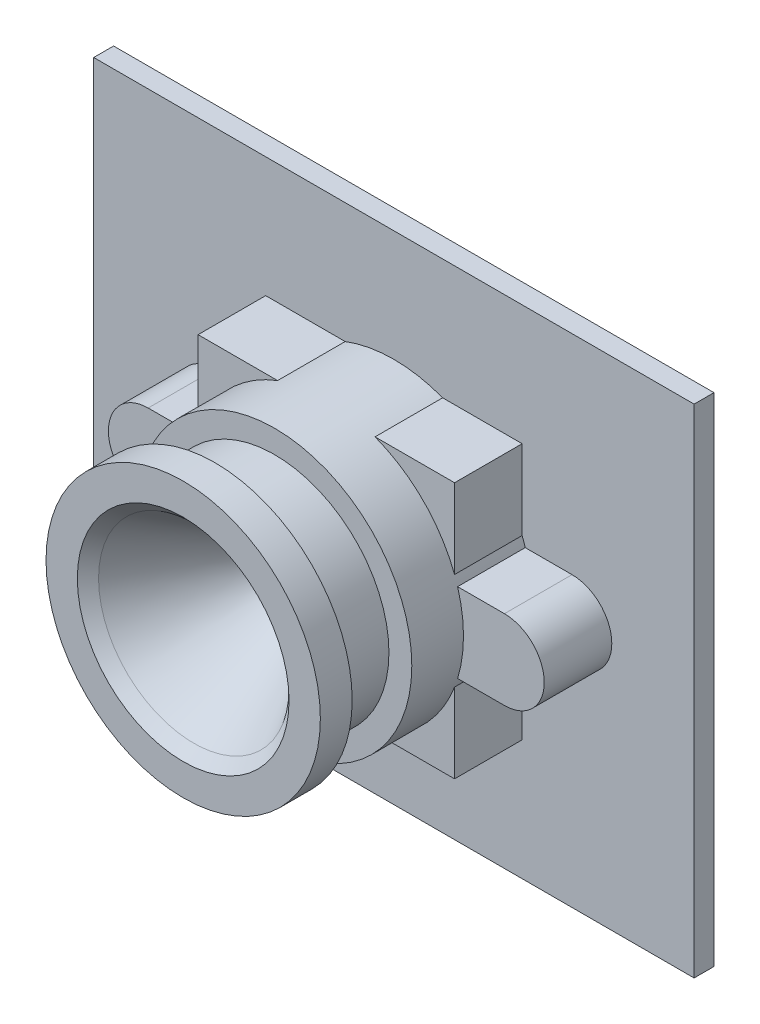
ISO-10303-21;
HEADER;
FILE_DESCRIPTION(('STEP AP214'),'2;1');
FILE_NAME('part.step','',(''),(''),'','','');
FILE_SCHEMA(('AUTOMOTIVE_DESIGN { 1 0 10303 214 1 1 1 1 }'));
ENDSEC;
DATA;
#1=APPLICATION_CONTEXT('core data for automotive mechanical design processes');
#2=APPLICATION_PROTOCOL_DEFINITION('international standard','automotive_design',2000,#1);
#3=PRODUCT_CONTEXT('',#1,'mechanical');
#4=PRODUCT('Part','Part','',(#3));
#5=PRODUCT_RELATED_PRODUCT_CATEGORY('part','',(#4));
#6=PRODUCT_DEFINITION_FORMATION('','',#4);
#7=PRODUCT_DEFINITION_CONTEXT('part definition',#1,'design');
#8=PRODUCT_DEFINITION('design','',#6,#7);
#9=PRODUCT_DEFINITION_SHAPE('','',#8);
#10=(LENGTH_UNIT() NAMED_UNIT(*) SI_UNIT(.MILLI.,.METRE.));
#11=(NAMED_UNIT(*) PLANE_ANGLE_UNIT() SI_UNIT($,.RADIAN.));
#12=(NAMED_UNIT(*) SI_UNIT($,.STERADIAN.) SOLID_ANGLE_UNIT());
#13=UNCERTAINTY_MEASURE_WITH_UNIT(LENGTH_MEASURE(1.E-05),#10,'distance_accuracy_value','');
#14=(GEOMETRIC_REPRESENTATION_CONTEXT(3) GLOBAL_UNCERTAINTY_ASSIGNED_CONTEXT((#13)) GLOBAL_UNIT_ASSIGNED_CONTEXT((#10,
#11,#12)) REPRESENTATION_CONTEXT('',''));
#15=CARTESIAN_POINT('',(0.,0.,0.));
#16=DIRECTION('',(0.,0.,1.));
#17=DIRECTION('',(1.,0.,0.));
#18=AXIS2_PLACEMENT_3D('',#15,#16,#17);
#19=CARTESIAN_POINT('',(-1.8,-12.5,-3.25));
#20=DIRECTION('',(-1.,0.,0.));
#21=DIRECTION('',(0.,0.,1.));
#22=AXIS2_PLACEMENT_3D('',#19,#20,#21);
#23=PLANE('',#22);
#24=DIRECTION('',(0.,-1.,0.));
#25=VECTOR('',#24,1.);
#26=CARTESIAN_POINT('',(-1.8,-12.5,0.));
#27=LINE('',#26,#25);
#28=CARTESIAN_POINT('',(-1.8,-8.1,0.));
#29=VERTEX_POINT('',#28);
#30=CARTESIAN_POINT('',(-1.8,-12.5,0.));
#31=VERTEX_POINT('',#30);
#32=EDGE_CURVE('E162',#29,#31,#27,.T.);
#33=ORIENTED_EDGE('',*,*,#32,.T.);
#34=DIRECTION('',(0.,0.,1.));
#35=VECTOR('',#34,1.);
#36=CARTESIAN_POINT('',(-1.8,-12.5,-3.25));
#37=LINE('',#36,#35);
#38=CARTESIAN_POINT('',(-1.8,-12.5,-3.25));
#39=VERTEX_POINT('',#38);
#40=EDGE_CURVE('E12',#39,#31,#37,.T.);
#41=ORIENTED_EDGE('',*,*,#40,.F.);
#42=DIRECTION('',(0.,-1.,0.));
#43=VECTOR('',#42,1.);
#44=CARTESIAN_POINT('',(-1.8,-12.5,-3.25));
#45=LINE('',#44,#43);
#46=CARTESIAN_POINT('',(-1.8,-8.1,-3.25));
#47=VERTEX_POINT('',#46);
#48=EDGE_CURVE('E166',#47,#39,#45,.T.);
#49=ORIENTED_EDGE('',*,*,#48,.F.);
#50=DIRECTION('',(0.,0.,1.));
#51=VECTOR('',#50,1.);
#52=CARTESIAN_POINT('',(-1.8,-8.1,-3.25));
#53=LINE('',#52,#51);
#54=EDGE_CURVE('E172',#47,#29,#53,.T.);
#55=ORIENTED_EDGE('',*,*,#54,.T.);
#56=EDGE_LOOP('',(#33,#41,#49,#55));
#57=FACE_BOUND('',#56,.T.);
#58=ADVANCED_FACE('F54',(#57),#23,.F.);
#59=CARTESIAN_POINT('',(-1.8,-12.5,-3.25));
#60=DIRECTION('',(0.,1.,0.));
#61=DIRECTION('',(0.,0.,1.));
#62=AXIS2_PLACEMENT_3D('',#59,#60,#61);
#63=PLANE('',#62);
#64=DIRECTION('',(1.,0.,0.));
#65=VECTOR('',#64,1.);
#66=CARTESIAN_POINT('',(-8.7,-12.5,-2.85));
#67=LINE('',#66,#65);
#68=CARTESIAN_POINT('',(-8.7,-12.5,-2.85));
#69=VERTEX_POINT('',#68);
#70=CARTESIAN_POINT('',(-2.2,-12.5,-2.85));
#71=VERTEX_POINT('',#70);
#72=EDGE_CURVE('E156',#69,#71,#67,.T.);
#73=ORIENTED_EDGE('',*,*,#72,.F.);
#74=DIRECTION('',(0.,0.,-1.));
#75=VECTOR('',#74,1.);
#76=CARTESIAN_POINT('',(-8.7,-12.5,-0.4));
#77=LINE('',#76,#75);
#78=CARTESIAN_POINT('',(-8.7,-12.5,-0.4));
#79=VERTEX_POINT('',#78);
#80=EDGE_CURVE('E68',#79,#69,#77,.T.);
#81=ORIENTED_EDGE('',*,*,#80,.F.);
#82=DIRECTION('',(-1.,0.,0.));
#83=VECTOR('',#82,1.);
#84=CARTESIAN_POINT('',(-8.7,-12.5,-0.4));
#85=LINE('',#84,#83);
#86=CARTESIAN_POINT('',(-2.2,-12.5,-0.4));
#87=VERTEX_POINT('',#86);
#88=EDGE_CURVE('E147',#87,#79,#85,.T.);
#89=ORIENTED_EDGE('',*,*,#88,.F.);
#90=DIRECTION('',(0.,0.,1.));
#91=VECTOR('',#90,1.);
#92=CARTESIAN_POINT('',(-2.2,-12.5,-0.4));
#93=LINE('',#92,#91);
#94=EDGE_CURVE('E150',#71,#87,#93,.T.);
#95=ORIENTED_EDGE('',*,*,#94,.F.);
#96=EDGE_LOOP('',(#73,#81,#89,#95));
#97=FACE_BOUND('',#96,.T.);
#98=DIRECTION('',(-1.,0.,0.));
#99=VECTOR('',#98,1.);
#100=CARTESIAN_POINT('',(-1.8,-12.5,0.));
#101=LINE('',#100,#99);
#102=CARTESIAN_POINT('',(-9.1,-12.5,0.));
#103=VERTEX_POINT('',#102);
#104=EDGE_CURVE('E175',#31,#103,#101,.T.);
#105=ORIENTED_EDGE('',*,*,#104,.T.);
#106=DIRECTION('',(0.,0.,1.));
#107=VECTOR('',#106,1.);
#108=CARTESIAN_POINT('',(-9.1,-12.5,-3.25));
#109=LINE('',#108,#107);
#110=CARTESIAN_POINT('',(-9.1,-12.5,-3.25));
#111=VERTEX_POINT('',#110);
#112=EDGE_CURVE('E61',#111,#103,#109,.T.);
#113=ORIENTED_EDGE('',*,*,#112,.F.);
#114=DIRECTION('',(-1.,0.,0.));
#115=VECTOR('',#114,1.);
#116=CARTESIAN_POINT('',(-1.8,-12.5,-3.25));
#117=LINE('',#116,#115);
#118=EDGE_CURVE('E105',#39,#111,#117,.T.);
#119=ORIENTED_EDGE('',*,*,#118,.F.);
#120=ORIENTED_EDGE('',*,*,#40,.T.);
#121=EDGE_LOOP('',(#105,#113,#119,#120));
#122=FACE_BOUND('',#121,.T.);
#123=ADVANCED_FACE('F203',(#97,#122),#63,.F.);
#124=CARTESIAN_POINT('',(-9.1,-12.5,-3.25));
#125=DIRECTION('',(1.,0.,0.));
#126=DIRECTION('',(0.,0.,-1.));
#127=AXIS2_PLACEMENT_3D('',#124,#125,#126);
#128=PLANE('',#127);
#129=DIRECTION('',(0.,1.,0.));
#130=VECTOR('',#129,1.);
#131=CARTESIAN_POINT('',(-9.1,-12.5,0.));
#132=LINE('',#131,#130);
#133=CARTESIAN_POINT('',(-9.1,-8.1,0.));
#134=VERTEX_POINT('',#133);
#135=EDGE_CURVE('E177',#103,#134,#132,.T.);
#136=ORIENTED_EDGE('',*,*,#135,.T.);
#137=DIRECTION('',(0.,0.,1.));
#138=VECTOR('',#137,1.);
#139=CARTESIAN_POINT('',(-9.1,-8.1,-3.25));
#140=LINE('',#139,#138);
#141=CARTESIAN_POINT('',(-9.1,-8.1,-3.25));
#142=VERTEX_POINT('',#141);
#143=EDGE_CURVE('E181',#142,#134,#140,.T.);
#144=ORIENTED_EDGE('',*,*,#143,.F.);
#145=DIRECTION('',(0.,1.,0.));
#146=VECTOR('',#145,1.);
#147=CARTESIAN_POINT('',(-9.1,-12.5,-3.25));
#148=LINE('',#147,#146);
#149=EDGE_CURVE('E169',#111,#142,#148,.T.);
#150=ORIENTED_EDGE('',*,*,#149,.F.);
#151=ORIENTED_EDGE('',*,*,#112,.T.);
#152=EDGE_LOOP('',(#136,#144,#150,#151));
#153=FACE_BOUND('',#152,.T.);
#154=ADVANCED_FACE('F186',(#153),#128,.F.);
#155=CARTESIAN_POINT('',(-1.8,-8.1,-3.25));
#156=DIRECTION('',(0.,-1.,0.));
#157=DIRECTION('',(0.,0.,-1.));
#158=AXIS2_PLACEMENT_3D('',#155,#156,#157);
#159=PLANE('',#158);
#160=DIRECTION('',(1.,0.,0.));
#161=VECTOR('',#160,1.);
#162=CARTESIAN_POINT('',(-1.8,-8.1,0.));
#163=LINE('',#162,#161);
#164=EDGE_CURVE('E98',#134,#29,#163,.T.);
#165=ORIENTED_EDGE('',*,*,#164,.T.);
#166=ORIENTED_EDGE('',*,*,#54,.F.);
#167=DIRECTION('',(1.,0.,0.));
#168=VECTOR('',#167,1.);
#169=CARTESIAN_POINT('',(-1.8,-8.1,-3.25));
#170=LINE('',#169,#168);
#171=EDGE_CURVE('E77',#142,#47,#170,.T.);
#172=ORIENTED_EDGE('',*,*,#171,.F.);
#173=ORIENTED_EDGE('',*,*,#143,.T.);
#174=EDGE_LOOP('',(#165,#166,#172,#173));
#175=FACE_BOUND('',#174,.T.);
#176=ADVANCED_FACE('F194',(#175),#159,.F.);
#177=CARTESIAN_POINT('',(0.,0.,-3.25));
#178=DIRECTION('',(0.,0.,1.));
#179=DIRECTION('',(1.,0.,0.));
#180=AXIS2_PLACEMENT_3D('',#177,#178,#179);
#181=PLANE('',#180);
#182=ORIENTED_EDGE('',*,*,#48,.T.);
#183=ORIENTED_EDGE('',*,*,#118,.T.);
#184=ORIENTED_EDGE('',*,*,#149,.T.);
#185=ORIENTED_EDGE('',*,*,#171,.T.);
#186=EDGE_LOOP('',(#182,#183,#184,#185));
#187=FACE_BOUND('',#186,.T.);
#188=ADVANCED_FACE('F196',(#187),#181,.F.);
#189=CARTESIAN_POINT('',(0.,0.,0.));
#190=DIRECTION('',(0.,0.,1.));
#191=DIRECTION('',(1.,0.,0.));
#192=AXIS2_PLACEMENT_3D('',#189,#190,#191);
#193=PLANE('',#192);
#194=ORIENTED_EDGE('',*,*,#32,.F.);
#195=ORIENTED_EDGE('',*,*,#164,.F.);
#196=ORIENTED_EDGE('',*,*,#135,.F.);
#197=ORIENTED_EDGE('',*,*,#104,.F.);
#198=EDGE_LOOP('',(#194,#195,#196,#197));
#199=FACE_BOUND('',#198,.T.);
#200=ADVANCED_FACE('F190',(#199),#193,.T.);
#201=CARTESIAN_POINT('',(-8.7,-8.5,-0.4));
#202=DIRECTION('',(-1.,0.,0.));
#203=DIRECTION('',(0.,0.,1.));
#204=AXIS2_PLACEMENT_3D('',#201,#202,#203);
#205=PLANE('',#204);
#206=ORIENTED_EDGE('',*,*,#80,.T.);
#207=DIRECTION('',(0.,-1.,0.));
#208=VECTOR('',#207,1.);
#209=CARTESIAN_POINT('',(-8.7,-8.5,-2.85));
#210=LINE('',#209,#208);
#211=CARTESIAN_POINT('',(-8.7,-8.5,-2.85));
#212=VERTEX_POINT('',#211);
#213=EDGE_CURVE('E125',#212,#69,#210,.T.);
#214=ORIENTED_EDGE('',*,*,#213,.F.);
#215=DIRECTION('',(0.,0.,-1.));
#216=VECTOR('',#215,1.);
#217=CARTESIAN_POINT('',(-8.7,-8.5,-0.4));
#218=LINE('',#217,#216);
#219=CARTESIAN_POINT('',(-8.7,-8.5,-0.4));
#220=VERTEX_POINT('',#219);
#221=EDGE_CURVE('E129',#220,#212,#218,.T.);
#222=ORIENTED_EDGE('',*,*,#221,.F.);
#223=DIRECTION('',(0.,-1.,0.));
#224=VECTOR('',#223,1.);
#225=CARTESIAN_POINT('',(-8.7,-8.5,-0.4));
#226=LINE('',#225,#224);
#227=EDGE_CURVE('E160',#220,#79,#226,.T.);
#228=ORIENTED_EDGE('',*,*,#227,.T.);
#229=EDGE_LOOP('',(#206,#214,#222,#228));
#230=FACE_BOUND('',#229,.T.);
#231=ADVANCED_FACE('F127',(#230),#205,.F.);
#232=CARTESIAN_POINT('',(-8.7,-8.5,-0.4));
#233=DIRECTION('',(0.,0.,1.));
#234=DIRECTION('',(1.,0.,0.));
#235=AXIS2_PLACEMENT_3D('',#232,#233,#234);
#236=PLANE('',#235);
#237=ORIENTED_EDGE('',*,*,#88,.T.);
#238=ORIENTED_EDGE('',*,*,#227,.F.);
#239=DIRECTION('',(-1.,0.,0.));
#240=VECTOR('',#239,1.);
#241=CARTESIAN_POINT('',(-8.7,-8.5,-0.4));
#242=LINE('',#241,#240);
#243=CARTESIAN_POINT('',(-2.2,-8.5,-0.4));
#244=VERTEX_POINT('',#243);
#245=EDGE_CURVE('E135',#244,#220,#242,.T.);
#246=ORIENTED_EDGE('',*,*,#245,.F.);
#247=DIRECTION('',(0.,-1.,0.));
#248=VECTOR('',#247,1.);
#249=CARTESIAN_POINT('',(-2.2,-8.5,-0.4));
#250=LINE('',#249,#248);
#251=EDGE_CURVE('E163',#244,#87,#250,.T.);
#252=ORIENTED_EDGE('',*,*,#251,.T.);
#253=EDGE_LOOP('',(#237,#238,#246,#252));
#254=FACE_BOUND('',#253,.T.);
#255=ADVANCED_FACE('F218',(#254),#236,.F.);
#256=CARTESIAN_POINT('',(-2.2,-8.5,-0.4));
#257=DIRECTION('',(1.,0.,0.));
#258=DIRECTION('',(0.,0.,-1.));
#259=AXIS2_PLACEMENT_3D('',#256,#257,#258);
#260=PLANE('',#259);
#261=ORIENTED_EDGE('',*,*,#94,.T.);
#262=ORIENTED_EDGE('',*,*,#251,.F.);
#263=DIRECTION('',(0.,0.,1.));
#264=VECTOR('',#263,1.);
#265=CARTESIAN_POINT('',(-2.2,-8.5,-0.4));
#266=LINE('',#265,#264);
#267=CARTESIAN_POINT('',(-2.2,-8.5,-2.85));
#268=VERTEX_POINT('',#267);
#269=EDGE_CURVE('E143',#268,#244,#266,.T.);
#270=ORIENTED_EDGE('',*,*,#269,.F.);
#271=DIRECTION('',(0.,-1.,0.));
#272=VECTOR('',#271,1.);
#273=CARTESIAN_POINT('',(-2.2,-8.5,-2.85));
#274=LINE('',#273,#272);
#275=EDGE_CURVE('E134',#268,#71,#274,.T.);
#276=ORIENTED_EDGE('',*,*,#275,.T.);
#277=EDGE_LOOP('',(#261,#262,#270,#276));
#278=FACE_BOUND('',#277,.T.);
#279=ADVANCED_FACE('F216',(#278),#260,.F.);
#280=CARTESIAN_POINT('',(-8.7,-8.5,-2.85));
#281=DIRECTION('',(0.,0.,-1.));
#282=DIRECTION('',(-1.,0.,0.));
#283=AXIS2_PLACEMENT_3D('',#280,#281,#282);
#284=PLANE('',#283);
#285=ORIENTED_EDGE('',*,*,#72,.T.);
#286=ORIENTED_EDGE('',*,*,#275,.F.);
#287=DIRECTION('',(1.,0.,0.));
#288=VECTOR('',#287,1.);
#289=CARTESIAN_POINT('',(-8.7,-8.5,-2.85));
#290=LINE('',#289,#288);
#291=EDGE_CURVE('E138',#212,#268,#290,.T.);
#292=ORIENTED_EDGE('',*,*,#291,.F.);
#293=ORIENTED_EDGE('',*,*,#213,.T.);
#294=EDGE_LOOP('',(#285,#286,#292,#293));
#295=FACE_BOUND('',#294,.T.);
#296=ADVANCED_FACE('F139',(#295),#284,.F.);
#297=CARTESIAN_POINT('',(0.,-8.5,0.));
#298=DIRECTION('',(0.,-1.,0.));
#299=DIRECTION('',(0.,0.,-1.));
#300=AXIS2_PLACEMENT_3D('',#297,#298,#299);
#301=PLANE('',#300);
#302=ORIENTED_EDGE('',*,*,#221,.T.);
#303=ORIENTED_EDGE('',*,*,#291,.T.);
#304=ORIENTED_EDGE('',*,*,#269,.T.);
#305=ORIENTED_EDGE('',*,*,#245,.T.);
#306=EDGE_LOOP('',(#302,#303,#304,#305));
#307=FACE_BOUND('',#306,.T.);
#308=ADVANCED_FACE('F145',(#307),#301,.T.);
#309=CLOSED_SHELL('',(#58,#123,#154,#176,#188,#200,#231,#255,#279,#296,#308));
#310=MANIFOLD_SOLID_BREP('B2',#309);
#311=CARTESIAN_POINT('',(-6.45,-6.45,4.4));
#312=DIRECTION('',(1.,0.,0.));
#313=DIRECTION('',(0.,0.,-1.));
#314=AXIS2_PLACEMENT_3D('',#311,#312,#313);
#315=PLANE('',#314);
#316=DIRECTION('',(0.,0.,-1.));
#317=VECTOR('',#316,1.);
#318=CARTESIAN_POINT('',(-6.45,-2.45102019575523,7.));
#319=LINE('',#318,#317);
#320=CARTESIAN_POINT('',(-6.45,-2.45102019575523,1.));
#321=VERTEX_POINT('',#320);
#322=CARTESIAN_POINT('',(-6.45,-2.45102019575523,4.4));
#323=VERTEX_POINT('',#322);
#324=EDGE_CURVE('E577',#321,#323,#319,.F.);
#325=ORIENTED_EDGE('',*,*,#324,.F.);
#326=DIRECTION('',(0.,-1.,0.));
#327=VECTOR('',#326,1.);
#328=CARTESIAN_POINT('',(-6.45,-6.45,1.));
#329=LINE('',#328,#327);
#330=CARTESIAN_POINT('',(-6.45,-6.45,1.));
#331=VERTEX_POINT('',#330);
#332=EDGE_CURVE('E586',#321,#331,#329,.T.);
#333=ORIENTED_EDGE('',*,*,#332,.T.);
#334=DIRECTION('',(0.,0.,-1.));
#335=VECTOR('',#334,1.);
#336=CARTESIAN_POINT('',(-6.45,-6.45,4.4));
#337=LINE('',#336,#335);
#338=CARTESIAN_POINT('',(-6.45,-6.45,4.4));
#339=VERTEX_POINT('',#338);
#340=EDGE_CURVE('E638',#339,#331,#337,.T.);
#341=ORIENTED_EDGE('',*,*,#340,.F.);
#342=DIRECTION('',(0.,-1.,0.));
#343=VECTOR('',#342,1.);
#344=CARTESIAN_POINT('',(-6.45,-6.45,4.4));
#345=LINE('',#344,#343);
#346=EDGE_CURVE('E592',#323,#339,#345,.T.);
#347=ORIENTED_EDGE('',*,*,#346,.F.);
#348=EDGE_LOOP('',(#325,#333,#341,#347));
#349=FACE_BOUND('',#348,.T.);
#350=ADVANCED_FACE('F315',(#349),#315,.F.);
#351=DIRECTION('',(0.,0.,-1.));
#352=VECTOR('',#351,1.);
#353=CARTESIAN_POINT('',(-6.45,2.45102019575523,7.));
#354=LINE('',#353,#352);
#355=CARTESIAN_POINT('',(-6.45,2.45102019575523,4.4));
#356=VERTEX_POINT('',#355);
#357=CARTESIAN_POINT('',(-6.45,2.45102019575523,1.));
#358=VERTEX_POINT('',#357);
#359=EDGE_CURVE('E571',#356,#358,#354,.T.);
#360=ORIENTED_EDGE('',*,*,#359,.F.);
#361=CARTESIAN_POINT('',(-6.45,6.45,4.4));
#362=VERTEX_POINT('',#361);
#363=EDGE_CURVE('E587',#362,#356,#345,.T.);
#364=ORIENTED_EDGE('',*,*,#363,.F.);
#365=DIRECTION('',(0.,0.,-1.));
#366=VECTOR('',#365,1.);
#367=CARTESIAN_POINT('',(-6.45,6.45,4.4));
#368=LINE('',#367,#366);
#369=CARTESIAN_POINT('',(-6.45,6.45,1.));
#370=VERTEX_POINT('',#369);
#371=EDGE_CURVE('E607',#362,#370,#368,.T.);
#372=ORIENTED_EDGE('',*,*,#371,.T.);
#373=EDGE_CURVE('E608',#370,#358,#329,.T.);
#374=ORIENTED_EDGE('',*,*,#373,.T.);
#375=EDGE_LOOP('',(#360,#364,#372,#374));
#376=FACE_BOUND('',#375,.T.);
#377=ADVANCED_FACE('F786',(#376),#315,.F.);
#378=CARTESIAN_POINT('',(6.45,-6.45,4.4));
#379=DIRECTION('',(0.,1.,0.));
#380=DIRECTION('',(0.,0.,1.));
#381=AXIS2_PLACEMENT_3D('',#378,#379,#380);
#382=PLANE('',#381);
#383=DIRECTION('',(0.,0.,-1.));
#384=VECTOR('',#383,1.);
#385=CARTESIAN_POINT('',(2.45102019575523,-6.45,7.));
#386=LINE('',#385,#384);
#387=CARTESIAN_POINT('',(2.45102019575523,-6.45,1.));
#388=VERTEX_POINT('',#387);
#389=CARTESIAN_POINT('',(2.45102019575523,-6.45,4.4));
#390=VERTEX_POINT('',#389);
#391=EDGE_CURVE('E583',#388,#390,#386,.F.);
#392=ORIENTED_EDGE('',*,*,#391,.F.);
#393=DIRECTION('',(1.,0.,0.));
#394=VECTOR('',#393,1.);
#395=CARTESIAN_POINT('',(6.45,-6.45,1.));
#396=LINE('',#395,#394);
#397=CARTESIAN_POINT('',(6.45,-6.45,1.));
#398=VERTEX_POINT('',#397);
#399=EDGE_CURVE('E612',#388,#398,#396,.T.);
#400=ORIENTED_EDGE('',*,*,#399,.T.);
#401=DIRECTION('',(0.,0.,-1.));
#402=VECTOR('',#401,1.);
#403=CARTESIAN_POINT('',(6.45,-6.45,4.4));
#404=LINE('',#403,#402);
#405=CARTESIAN_POINT('',(6.45,-6.45,4.4));
#406=VERTEX_POINT('',#405);
#407=EDGE_CURVE('E634',#406,#398,#404,.T.);
#408=ORIENTED_EDGE('',*,*,#407,.F.);
#409=DIRECTION('',(1.,0.,0.));
#410=VECTOR('',#409,1.);
#411=CARTESIAN_POINT('',(6.45,-6.45,4.4));
#412=LINE('',#411,#410);
#413=EDGE_CURVE('E591',#390,#406,#412,.T.);
#414=ORIENTED_EDGE('',*,*,#413,.F.);
#415=EDGE_LOOP('',(#392,#400,#408,#414));
#416=FACE_BOUND('',#415,.T.);
#417=ADVANCED_FACE('F799',(#416),#382,.F.);
#418=DIRECTION('',(0.,0.,-1.));
#419=VECTOR('',#418,1.);
#420=CARTESIAN_POINT('',(-2.45102019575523,-6.45,7.));
#421=LINE('',#420,#419);
#422=CARTESIAN_POINT('',(-2.45102019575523,-6.45,4.4));
#423=VERTEX_POINT('',#422);
#424=CARTESIAN_POINT('',(-2.45102019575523,-6.45,1.));
#425=VERTEX_POINT('',#424);
#426=EDGE_CURVE('E574',#423,#425,#421,.T.);
#427=ORIENTED_EDGE('',*,*,#426,.F.);
#428=EDGE_CURVE('E593',#339,#423,#412,.T.);
#429=ORIENTED_EDGE('',*,*,#428,.F.);
#430=ORIENTED_EDGE('',*,*,#340,.T.);
#431=EDGE_CURVE('E613',#331,#425,#396,.T.);
#432=ORIENTED_EDGE('',*,*,#431,.T.);
#433=EDGE_LOOP('',(#427,#429,#430,#432));
#434=FACE_BOUND('',#433,.T.);
#435=ADVANCED_FACE('F771',(#434),#382,.F.);
#436=CARTESIAN_POINT('',(6.45,-6.45,4.4));
#437=DIRECTION('',(-1.,0.,0.));
#438=DIRECTION('',(0.,0.,1.));
#439=AXIS2_PLACEMENT_3D('',#436,#437,#438);
#440=PLANE('',#439);
#441=DIRECTION('',(0.,0.,-1.));
#442=VECTOR('',#441,1.);
#443=CARTESIAN_POINT('',(6.45,2.45102019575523,7.));
#444=LINE('',#443,#442);
#445=CARTESIAN_POINT('',(6.45,2.45102019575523,1.));
#446=VERTEX_POINT('',#445);
#447=CARTESIAN_POINT('',(6.45,2.45102019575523,4.4));
#448=VERTEX_POINT('',#447);
#449=EDGE_CURVE('E565',#446,#448,#444,.F.);
#450=ORIENTED_EDGE('',*,*,#449,.F.);
#451=DIRECTION('',(0.,1.,0.));
#452=VECTOR('',#451,1.);
#453=CARTESIAN_POINT('',(6.45,-6.45,1.));
#454=LINE('',#453,#452);
#455=CARTESIAN_POINT('',(6.45,6.45,1.));
#456=VERTEX_POINT('',#455);
#457=EDGE_CURVE('E617',#446,#456,#454,.T.);
#458=ORIENTED_EDGE('',*,*,#457,.T.);
#459=DIRECTION('',(0.,0.,-1.));
#460=VECTOR('',#459,1.);
#461=CARTESIAN_POINT('',(6.45,6.45,4.4));
#462=LINE('',#461,#460);
#463=CARTESIAN_POINT('',(6.45,6.45,4.4));
#464=VERTEX_POINT('',#463);
#465=EDGE_CURVE('E630',#464,#456,#462,.T.);
#466=ORIENTED_EDGE('',*,*,#465,.F.);
#467=DIRECTION('',(0.,1.,0.));
#468=VECTOR('',#467,1.);
#469=CARTESIAN_POINT('',(6.45,-6.45,4.4));
#470=LINE('',#469,#468);
#471=EDGE_CURVE('E597',#448,#464,#470,.T.);
#472=ORIENTED_EDGE('',*,*,#471,.F.);
#473=EDGE_LOOP('',(#450,#458,#466,#472));
#474=FACE_BOUND('',#473,.T.);
#475=ADVANCED_FACE('F753',(#474),#440,.F.);
#476=DIRECTION('',(0.,0.,-1.));
#477=VECTOR('',#476,1.);
#478=CARTESIAN_POINT('',(6.45,-2.45102019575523,7.));
#479=LINE('',#478,#477);
#480=CARTESIAN_POINT('',(6.45,-2.45102019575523,4.4));
#481=VERTEX_POINT('',#480);
#482=CARTESIAN_POINT('',(6.45,-2.45102019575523,1.));
#483=VERTEX_POINT('',#482);
#484=EDGE_CURVE('E580',#481,#483,#479,.T.);
#485=ORIENTED_EDGE('',*,*,#484,.F.);
#486=EDGE_CURVE('E598',#406,#481,#470,.T.);
#487=ORIENTED_EDGE('',*,*,#486,.F.);
#488=ORIENTED_EDGE('',*,*,#407,.T.);
#489=EDGE_CURVE('E618',#398,#483,#454,.T.);
#490=ORIENTED_EDGE('',*,*,#489,.T.);
#491=EDGE_LOOP('',(#485,#487,#488,#490));
#492=FACE_BOUND('',#491,.T.);
#493=ADVANCED_FACE('F803',(#492),#440,.F.);
#494=CARTESIAN_POINT('',(6.45,6.45,4.4));
#495=DIRECTION('',(0.,-1.,0.));
#496=DIRECTION('',(1.,0.,0.));
#497=AXIS2_PLACEMENT_3D('',#494,#495,#496);
#498=PLANE('',#497);
#499=DIRECTION('',(0.,0.,-1.));
#500=VECTOR('',#499,1.);
#501=CARTESIAN_POINT('',(-2.45102019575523,6.45,7.));
#502=LINE('',#501,#500);
#503=CARTESIAN_POINT('',(-2.45102019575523,6.45,1.));
#504=VERTEX_POINT('',#503);
#505=CARTESIAN_POINT('',(-2.45102019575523,6.45,4.4));
#506=VERTEX_POINT('',#505);
#507=EDGE_CURVE('E568',#504,#506,#502,.F.);
#508=ORIENTED_EDGE('',*,*,#507,.F.);
#509=DIRECTION('',(-1.,0.,0.));
#510=VECTOR('',#509,1.);
#511=CARTESIAN_POINT('',(6.45,6.45,1.));
#512=LINE('',#511,#510);
#513=EDGE_CURVE('E622',#504,#370,#512,.T.);
#514=ORIENTED_EDGE('',*,*,#513,.T.);
#515=ORIENTED_EDGE('',*,*,#371,.F.);
#516=DIRECTION('',(-1.,0.,0.));
#517=VECTOR('',#516,1.);
#518=CARTESIAN_POINT('',(6.45,6.45,4.4));
#519=LINE('',#518,#517);
#520=EDGE_CURVE('E602',#506,#362,#519,.T.);
#521=ORIENTED_EDGE('',*,*,#520,.F.);
#522=EDGE_LOOP('',(#508,#514,#515,#521));
#523=FACE_BOUND('',#522,.T.);
#524=ADVANCED_FACE('F782',(#523),#498,.F.);
#525=DIRECTION('',(0.,0.,-1.));
#526=VECTOR('',#525,1.);
#527=CARTESIAN_POINT('',(2.45102019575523,6.45,7.));
#528=LINE('',#527,#526);
#529=CARTESIAN_POINT('',(2.45102019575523,6.45,4.4));
#530=VERTEX_POINT('',#529);
#531=CARTESIAN_POINT('',(2.45102019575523,6.45,1.));
#532=VERTEX_POINT('',#531);
#533=EDGE_CURVE('E555',#530,#532,#528,.T.);
#534=ORIENTED_EDGE('',*,*,#533,.F.);
#535=EDGE_CURVE('E603',#464,#530,#519,.T.);
#536=ORIENTED_EDGE('',*,*,#535,.F.);
#537=ORIENTED_EDGE('',*,*,#465,.T.);
#538=EDGE_CURVE('E623',#456,#532,#512,.T.);
#539=ORIENTED_EDGE('',*,*,#538,.T.);
#540=EDGE_LOOP('',(#534,#536,#537,#539));
#541=FACE_BOUND('',#540,.T.);
#542=ADVANCED_FACE('F875',(#541),#498,.F.);
#543=CARTESIAN_POINT('',(0.,0.,4.4));
#544=DIRECTION('',(0.,0.,1.));
#545=DIRECTION('',(1.,0.,0.));
#546=AXIS2_PLACEMENT_3D('',#543,#544,#545);
#547=PLANE('',#546);
#548=ORIENTED_EDGE('',*,*,#486,.T.);
#549=CARTESIAN_POINT('',(0.,0.,4.4));
#550=DIRECTION('',(0.,0.,1.));
#551=DIRECTION('',(1.,0.,0.));
#552=AXIS2_PLACEMENT_3D('',#549,#550,#551);
#553=CIRCLE('',#552,6.9);
#554=EDGE_CURVE('E550',#481,#390,#553,.F.);
#555=ORIENTED_EDGE('',*,*,#554,.T.);
#556=ORIENTED_EDGE('',*,*,#413,.T.);
#557=EDGE_LOOP('',(#548,#555,#556));
#558=FACE_BOUND('',#557,.T.);
#559=ADVANCED_FACE('F796',(#558),#547,.T.);
#560=ORIENTED_EDGE('',*,*,#428,.T.);
#561=EDGE_CURVE('E775',#423,#323,#553,.F.);
#562=ORIENTED_EDGE('',*,*,#561,.T.);
#563=ORIENTED_EDGE('',*,*,#346,.T.);
#564=EDGE_LOOP('',(#560,#562,#563));
#565=FACE_BOUND('',#564,.T.);
#566=ADVANCED_FACE('F774',(#565),#547,.T.);
#567=ORIENTED_EDGE('',*,*,#363,.T.);
#568=EDGE_CURVE('E688',#356,#506,#553,.F.);
#569=ORIENTED_EDGE('',*,*,#568,.T.);
#570=ORIENTED_EDGE('',*,*,#520,.T.);
#571=EDGE_LOOP('',(#567,#569,#570));
#572=FACE_BOUND('',#571,.T.);
#573=ADVANCED_FACE('F789',(#572),#547,.T.);
#574=CARTESIAN_POINT('',(-15.1,-12.5,1.));
#575=DIRECTION('',(1.,0.,0.));
#576=DIRECTION('',(0.,0.,-1.));
#577=AXIS2_PLACEMENT_3D('',#574,#575,#576);
#578=PLANE('',#577);
#579=DIRECTION('',(0.,-1.,0.));
#580=VECTOR('',#579,1.);
#581=CARTESIAN_POINT('',(-15.1,-12.5,0.));
#582=LINE('',#581,#580);
#583=CARTESIAN_POINT('',(-15.1,12.5,0.));
#584=VERTEX_POINT('',#583);
#585=CARTESIAN_POINT('',(-15.1,-12.5,0.));
#586=VERTEX_POINT('',#585);
#587=EDGE_CURVE('E642',#584,#586,#582,.T.);
#588=ORIENTED_EDGE('',*,*,#587,.T.);
#589=DIRECTION('',(0.,0.,-1.));
#590=VECTOR('',#589,1.);
#591=CARTESIAN_POINT('',(-15.1,-12.5,1.));
#592=LINE('',#591,#590);
#593=CARTESIAN_POINT('',(-15.1,-12.5,1.));
#594=VERTEX_POINT('',#593);
#595=EDGE_CURVE('E680',#594,#586,#592,.T.);
#596=ORIENTED_EDGE('',*,*,#595,.F.);
#597=DIRECTION('',(0.,-1.,0.));
#598=VECTOR('',#597,1.);
#599=CARTESIAN_POINT('',(-15.1,-12.5,1.));
#600=LINE('',#599,#598);
#601=CARTESIAN_POINT('',(-15.1,12.5,1.));
#602=VERTEX_POINT('',#601);
#603=EDGE_CURVE('E643',#602,#594,#600,.T.);
#604=ORIENTED_EDGE('',*,*,#603,.F.);
#605=DIRECTION('',(0.,0.,-1.));
#606=VECTOR('',#605,1.);
#607=CARTESIAN_POINT('',(-15.1,12.5,1.));
#608=LINE('',#607,#606);
#609=EDGE_CURVE('E657',#602,#584,#608,.T.);
#610=ORIENTED_EDGE('',*,*,#609,.T.);
#611=EDGE_LOOP('',(#588,#596,#604,#610));
#612=FACE_BOUND('',#611,.T.);
#613=ADVANCED_FACE('F844',(#612),#578,.F.);
#614=CARTESIAN_POINT('',(15.1,-12.5,1.));
#615=DIRECTION('',(0.,1.,0.));
#616=DIRECTION('',(-1.,0.,0.));
#617=AXIS2_PLACEMENT_3D('',#614,#615,#616);
#618=PLANE('',#617);
#619=DIRECTION('',(1.,0.,0.));
#620=VECTOR('',#619,1.);
#621=CARTESIAN_POINT('',(15.1,-12.5,0.));
#622=LINE('',#621,#620);
#623=CARTESIAN_POINT('',(15.1,-12.5,0.));
#624=VERTEX_POINT('',#623);
#625=EDGE_CURVE('E661',#586,#624,#622,.T.);
#626=ORIENTED_EDGE('',*,*,#625,.T.);
#627=DIRECTION('',(0.,0.,-1.));
#628=VECTOR('',#627,1.);
#629=CARTESIAN_POINT('',(15.1,-12.5,1.));
#630=LINE('',#629,#628);
#631=CARTESIAN_POINT('',(15.1,-12.5,1.));
#632=VERTEX_POINT('',#631);
#633=EDGE_CURVE('E676',#632,#624,#630,.T.);
#634=ORIENTED_EDGE('',*,*,#633,.F.);
#635=DIRECTION('',(1.,0.,0.));
#636=VECTOR('',#635,1.);
#637=CARTESIAN_POINT('',(15.1,-12.5,1.));
#638=LINE('',#637,#636);
#639=EDGE_CURVE('E647',#594,#632,#638,.T.);
#640=ORIENTED_EDGE('',*,*,#639,.F.);
#641=ORIENTED_EDGE('',*,*,#595,.T.);
#642=EDGE_LOOP('',(#626,#634,#640,#641));
#643=FACE_BOUND('',#642,.T.);
#644=ADVANCED_FACE('F841',(#643),#618,.F.);
#645=CARTESIAN_POINT('',(15.1,-12.5,1.));
#646=DIRECTION('',(-1.,0.,0.));
#647=DIRECTION('',(0.,0.,1.));
#648=AXIS2_PLACEMENT_3D('',#645,#646,#647);
#649=PLANE('',#648);
#650=DIRECTION('',(0.,1.,0.));
#651=VECTOR('',#650,1.);
#652=CARTESIAN_POINT('',(15.1,-12.5,0.));
#653=LINE('',#652,#651);
#654=CARTESIAN_POINT('',(15.1,12.5,0.));
#655=VERTEX_POINT('',#654);
#656=EDGE_CURVE('E664',#624,#655,#653,.T.);
#657=ORIENTED_EDGE('',*,*,#656,.T.);
#658=DIRECTION('',(0.,0.,-1.));
#659=VECTOR('',#658,1.);
#660=CARTESIAN_POINT('',(15.1,12.5,1.));
#661=LINE('',#660,#659);
#662=CARTESIAN_POINT('',(15.1,12.5,1.));
#663=VERTEX_POINT('',#662);
#664=EDGE_CURVE('E672',#663,#655,#661,.T.);
#665=ORIENTED_EDGE('',*,*,#664,.F.);
#666=DIRECTION('',(0.,1.,0.));
#667=VECTOR('',#666,1.);
#668=CARTESIAN_POINT('',(15.1,-12.5,1.));
#669=LINE('',#668,#667);
#670=EDGE_CURVE('E651',#632,#663,#669,.T.);
#671=ORIENTED_EDGE('',*,*,#670,.F.);
#672=ORIENTED_EDGE('',*,*,#633,.T.);
#673=EDGE_LOOP('',(#657,#665,#671,#672));
#674=FACE_BOUND('',#673,.T.);
#675=ADVANCED_FACE('F837',(#674),#649,.F.);
#676=CARTESIAN_POINT('',(15.1,12.5,1.));
#677=DIRECTION('',(0.,-1.,0.));
#678=DIRECTION('',(1.,0.,0.));
#679=AXIS2_PLACEMENT_3D('',#676,#677,#678);
#680=PLANE('',#679);
#681=DIRECTION('',(-1.,0.,0.));
#682=VECTOR('',#681,1.);
#683=CARTESIAN_POINT('',(15.1,12.5,0.));
#684=LINE('',#683,#682);
#685=EDGE_CURVE('E648',#655,#584,#684,.T.);
#686=ORIENTED_EDGE('',*,*,#685,.T.);
#687=ORIENTED_EDGE('',*,*,#609,.F.);
#688=DIRECTION('',(-1.,0.,0.));
#689=VECTOR('',#688,1.);
#690=CARTESIAN_POINT('',(15.1,12.5,1.));
#691=LINE('',#690,#689);
#692=EDGE_CURVE('E654',#663,#602,#691,.T.);
#693=ORIENTED_EDGE('',*,*,#692,.F.);
#694=ORIENTED_EDGE('',*,*,#664,.T.);
#695=EDGE_LOOP('',(#686,#687,#693,#694));
#696=FACE_BOUND('',#695,.T.);
#697=ADVANCED_FACE('F830',(#696),#680,.F.);
#698=CARTESIAN_POINT('',(0.,0.,1.));
#699=DIRECTION('',(0.,0.,1.));
#700=DIRECTION('',(1.,0.,0.));
#701=AXIS2_PLACEMENT_3D('',#698,#699,#700);
#702=PLANE('',#701);
#703=DIRECTION('',(-1.,0.,0.));
#704=VECTOR('',#703,1.);
#705=CARTESIAN_POINT('',(8.96,-2.,1.));
#706=LINE('',#705,#704);
#707=CARTESIAN_POINT('',(8.96,-2.,1.));
#708=VERTEX_POINT('',#707);
#709=CARTESIAN_POINT('',(6.60378679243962,-2.,1.));
#710=VERTEX_POINT('',#709);
#711=EDGE_CURVE('E730',#708,#710,#706,.T.);
#712=ORIENTED_EDGE('',*,*,#711,.T.);
#713=CARTESIAN_POINT('',(0.,0.,1.));
#714=DIRECTION('',(0.,0.,1.));
#715=DIRECTION('',(1.,0.,0.));
#716=AXIS2_PLACEMENT_3D('',#713,#714,#715);
#717=CIRCLE('',#716,6.9);
#718=EDGE_CURVE('E557',#483,#710,#717,.T.);
#719=ORIENTED_EDGE('',*,*,#718,.F.);
#720=ORIENTED_EDGE('',*,*,#489,.F.);
#721=ORIENTED_EDGE('',*,*,#399,.F.);
#722=EDGE_CURVE('E561',#425,#388,#717,.T.);
#723=ORIENTED_EDGE('',*,*,#722,.F.);
#724=ORIENTED_EDGE('',*,*,#431,.F.);
#725=ORIENTED_EDGE('',*,*,#332,.F.);
#726=CARTESIAN_POINT('',(-6.60378679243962,-2.,1.));
#727=VERTEX_POINT('',#726);
#728=EDGE_CURVE('E562',#727,#321,#717,.T.);
#729=ORIENTED_EDGE('',*,*,#728,.F.);
#730=CARTESIAN_POINT('',(-8.96,-2.,1.));
#731=VERTEX_POINT('',#730);
#732=EDGE_CURVE('E727',#727,#731,#706,.T.);
#733=ORIENTED_EDGE('',*,*,#732,.T.);
#734=CARTESIAN_POINT('',(-8.96,0.,1.));
#735=DIRECTION('',(0.,0.,1.));
#736=DIRECTION('',(1.,0.,0.));
#737=AXIS2_PLACEMENT_3D('',#734,#735,#736);
#738=CIRCLE('',#737,2.);
#739=CARTESIAN_POINT('',(-8.96,2.,1.));
#740=VERTEX_POINT('',#739);
#741=EDGE_CURVE('E516',#731,#740,#738,.F.);
#742=ORIENTED_EDGE('',*,*,#741,.T.);
#743=DIRECTION('',(1.,0.,0.));
#744=VECTOR('',#743,1.);
#745=CARTESIAN_POINT('',(8.96,2.,1.));
#746=LINE('',#745,#744);
#747=CARTESIAN_POINT('',(-6.60378679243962,2.,1.));
#748=VERTEX_POINT('',#747);
#749=EDGE_CURVE('E523',#740,#748,#746,.T.);
#750=ORIENTED_EDGE('',*,*,#749,.T.);
#751=EDGE_CURVE('E739',#358,#748,#717,.T.);
#752=ORIENTED_EDGE('',*,*,#751,.F.);
#753=ORIENTED_EDGE('',*,*,#373,.F.);
#754=ORIENTED_EDGE('',*,*,#513,.F.);
#755=EDGE_CURVE('E556',#532,#504,#717,.T.);
#756=ORIENTED_EDGE('',*,*,#755,.F.);
#757=ORIENTED_EDGE('',*,*,#538,.F.);
#758=ORIENTED_EDGE('',*,*,#457,.F.);
#759=CARTESIAN_POINT('',(6.60378679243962,2.,1.));
#760=VERTEX_POINT('',#759);
#761=EDGE_CURVE('E544',#760,#446,#717,.T.);
#762=ORIENTED_EDGE('',*,*,#761,.F.);
#763=CARTESIAN_POINT('',(8.96,2.,1.));
#764=VERTEX_POINT('',#763);
#765=EDGE_CURVE('E528',#760,#764,#746,.T.);
#766=ORIENTED_EDGE('',*,*,#765,.T.);
#767=CARTESIAN_POINT('',(8.96,0.,1.));
#768=DIRECTION('',(0.,0.,1.));
#769=DIRECTION('',(1.,0.,0.));
#770=AXIS2_PLACEMENT_3D('',#767,#768,#769);
#771=CIRCLE('',#770,2.);
#772=EDGE_CURVE('E485',#764,#708,#771,.F.);
#773=ORIENTED_EDGE('',*,*,#772,.T.);
#774=EDGE_LOOP('',(#712,#719,#720,#721,#723,#724,#725,#729,#733,#742,#750,#752,#753,#754,#756,
#757,#758,#762,#766,#773));
#775=FACE_BOUND('',#774,.T.);
#776=ORIENTED_EDGE('',*,*,#603,.T.);
#777=ORIENTED_EDGE('',*,*,#639,.T.);
#778=ORIENTED_EDGE('',*,*,#670,.T.);
#779=ORIENTED_EDGE('',*,*,#692,.T.);
#780=EDGE_LOOP('',(#776,#777,#778,#779));
#781=FACE_BOUND('',#780,.T.);
#782=ADVANCED_FACE('F735',(#775,#781),#702,.T.);
#783=CARTESIAN_POINT('',(0.,0.,0.));
#784=DIRECTION('',(0.,0.,1.));
#785=DIRECTION('',(1.,0.,0.));
#786=AXIS2_PLACEMENT_3D('',#783,#784,#785);
#787=PLANE('',#786);
#788=ORIENTED_EDGE('',*,*,#587,.F.);
#789=ORIENTED_EDGE('',*,*,#685,.F.);
#790=ORIENTED_EDGE('',*,*,#656,.F.);
#791=ORIENTED_EDGE('',*,*,#625,.F.);
#792=EDGE_LOOP('',(#788,#789,#790,#791));
#793=FACE_BOUND('',#792,.T.);
#794=ADVANCED_FACE('F829',(#793),#787,.F.);
#795=ORIENTED_EDGE('',*,*,#535,.T.);
#796=EDGE_CURVE('E684',#530,#448,#553,.F.);
#797=ORIENTED_EDGE('',*,*,#796,.T.);
#798=ORIENTED_EDGE('',*,*,#471,.T.);
#799=EDGE_LOOP('',(#795,#797,#798));
#800=FACE_BOUND('',#799,.T.);
#801=ADVANCED_FACE('F833',(#800),#547,.T.);
#802=CARTESIAN_POINT('',(0.,0.,7.));
#803=DIRECTION('',(0.,0.,-1.));
#804=DIRECTION('',(-1.,0.,0.));
#805=AXIS2_PLACEMENT_3D('',#802,#803,#804);
#806=CYLINDRICAL_SURFACE('',#805,6.9);
#807=CARTESIAN_POINT('',(0.,0.,4.4));
#808=DIRECTION('',(0.,0.,1.));
#809=DIRECTION('',(1.,0.,0.));
#810=AXIS2_PLACEMENT_3D('',#807,#808,#809);
#811=CIRCLE('',#810,6.9);
#812=CARTESIAN_POINT('',(-6.60378679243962,2.,4.4));
#813=VERTEX_POINT('',#812);
#814=CARTESIAN_POINT('',(-6.60378679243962,-2.,4.4));
#815=VERTEX_POINT('',#814);
#816=EDGE_CURVE('E699',#813,#815,#811,.T.);
#817=ORIENTED_EDGE('',*,*,#816,.T.);
#818=DIRECTION('',(0.,0.,-1.));
#819=VECTOR('',#818,1.);
#820=CARTESIAN_POINT('',(-6.60378679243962,-2.,7.));
#821=LINE('',#820,#819);
#822=EDGE_CURVE('E52',#815,#727,#821,.T.);
#823=ORIENTED_EDGE('',*,*,#822,.T.);
#824=ORIENTED_EDGE('',*,*,#728,.T.);
#825=ORIENTED_EDGE('',*,*,#324,.T.);
#826=ORIENTED_EDGE('',*,*,#561,.F.);
#827=ORIENTED_EDGE('',*,*,#426,.T.);
#828=ORIENTED_EDGE('',*,*,#722,.T.);
#829=ORIENTED_EDGE('',*,*,#391,.T.);
#830=ORIENTED_EDGE('',*,*,#554,.F.);
#831=ORIENTED_EDGE('',*,*,#484,.T.);
#832=ORIENTED_EDGE('',*,*,#718,.T.);
#833=DIRECTION('',(0.,0.,-1.));
#834=VECTOR('',#833,1.);
#835=CARTESIAN_POINT('',(6.60378679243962,-2.,7.));
#836=LINE('',#835,#834);
#837=CARTESIAN_POINT('',(6.60378679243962,-2.,4.4));
#838=VERTEX_POINT('',#837);
#839=EDGE_CURVE('E702',#710,#838,#836,.F.);
#840=ORIENTED_EDGE('',*,*,#839,.T.);
#841=CARTESIAN_POINT('',(6.60378679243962,2.,4.4));
#842=VERTEX_POINT('',#841);
#843=EDGE_CURVE('E696',#838,#842,#811,.T.);
#844=ORIENTED_EDGE('',*,*,#843,.T.);
#845=DIRECTION('',(0.,0.,-1.));
#846=VECTOR('',#845,1.);
#847=CARTESIAN_POINT('',(6.60378679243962,2.,7.));
#848=LINE('',#847,#846);
#849=EDGE_CURVE('E493',#842,#760,#848,.T.);
#850=ORIENTED_EDGE('',*,*,#849,.T.);
#851=ORIENTED_EDGE('',*,*,#761,.T.);
#852=ORIENTED_EDGE('',*,*,#449,.T.);
#853=ORIENTED_EDGE('',*,*,#796,.F.);
#854=ORIENTED_EDGE('',*,*,#533,.T.);
#855=ORIENTED_EDGE('',*,*,#755,.T.);
#856=ORIENTED_EDGE('',*,*,#507,.T.);
#857=ORIENTED_EDGE('',*,*,#568,.F.);
#858=ORIENTED_EDGE('',*,*,#359,.T.);
#859=ORIENTED_EDGE('',*,*,#751,.T.);
#860=DIRECTION('',(0.,0.,-1.));
#861=VECTOR('',#860,1.);
#862=CARTESIAN_POINT('',(-6.60378679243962,2.,7.));
#863=LINE('',#862,#861);
#864=EDGE_CURVE('E325',#748,#813,#863,.F.);
#865=ORIENTED_EDGE('',*,*,#864,.T.);
#866=EDGE_LOOP('',(#817,#823,#824,#825,#826,#827,#828,#829,#830,#831,#832,#840,#844,#850,#851,
#852,#853,#854,#855,#856,#857,#858,#859,#865));
#867=FACE_BOUND('',#866,.T.);
#868=CARTESIAN_POINT('',(0.,0.,7.));
#869=DIRECTION('',(0.,0.,1.));
#870=DIRECTION('',(1.,0.,0.));
#871=AXIS2_PLACEMENT_3D('',#868,#869,#870);
#872=CIRCLE('',#871,6.9);
#873=CARTESIAN_POINT('',(6.9,0.,7.));
#874=VERTEX_POINT('',#873);
#875=EDGE_CURVE('E551',#874,#874,#872,.T.);
#876=ORIENTED_EDGE('',*,*,#875,.F.);
#877=EDGE_LOOP('',(#876));
#878=FACE_BOUND('',#877,.T.);
#879=ADVANCED_FACE('F711',(#867,#878),#806,.T.);
#880=CARTESIAN_POINT('',(0.,0.,7.));
#881=DIRECTION('',(0.,0.,1.));
#882=DIRECTION('',(1.,0.,0.));
#883=AXIS2_PLACEMENT_3D('',#880,#881,#882);
#884=PLANE('',#883);
#885=CARTESIAN_POINT('',(0.,0.,7.));
#886=DIRECTION('',(0.,0.,1.));
#887=DIRECTION('',(1.,0.,0.));
#888=AXIS2_PLACEMENT_3D('',#885,#886,#887);
#889=CIRCLE('',#888,5.75);
#890=CARTESIAN_POINT('',(5.75,0.,7.));
#891=VERTEX_POINT('',#890);
#892=EDGE_CURVE('E545',#891,#891,#889,.T.);
#893=ORIENTED_EDGE('',*,*,#892,.F.);
#894=EDGE_LOOP('',(#893));
#895=FACE_BOUND('',#894,.T.);
#896=ORIENTED_EDGE('',*,*,#875,.T.);
#897=EDGE_LOOP('',(#896));
#898=FACE_BOUND('',#897,.T.);
#899=ADVANCED_FACE('F873',(#895,#898),#884,.T.);
#900=CARTESIAN_POINT('',(0.,0.,10.));
#901=DIRECTION('',(0.,0.,-1.));
#902=DIRECTION('',(-1.,0.,0.));
#903=AXIS2_PLACEMENT_3D('',#900,#901,#902);
#904=CYLINDRICAL_SURFACE('',#903,5.75);
#905=CARTESIAN_POINT('',(0.,0.,10.));
#906=DIRECTION('',(0.,0.,1.));
#907=DIRECTION('',(1.,0.,0.));
#908=AXIS2_PLACEMENT_3D('',#905,#906,#907);
#909=CIRCLE('',#908,5.75);
#910=CARTESIAN_POINT('',(5.75,0.,10.));
#911=VERTEX_POINT('',#910);
#912=EDGE_CURVE('E537',#911,#911,#909,.T.);
#913=ORIENTED_EDGE('',*,*,#912,.F.);
#914=EDGE_LOOP('',(#913));
#915=FACE_BOUND('',#914,.T.);
#916=ORIENTED_EDGE('',*,*,#892,.T.);
#917=EDGE_LOOP('',(#916));
#918=FACE_BOUND('',#917,.T.);
#919=ADVANCED_FACE('F1026',(#915,#918),#904,.T.);
#920=CARTESIAN_POINT('',(0.,0.,11.6));
#921=DIRECTION('',(0.,0.,-1.));
#922=DIRECTION('',(-1.,0.,0.));
#923=AXIS2_PLACEMENT_3D('',#920,#921,#922);
#924=CYLINDRICAL_SURFACE('',#923,6.9);
#925=CARTESIAN_POINT('',(0.,0.,11.6));
#926=DIRECTION('',(0.,0.,1.));
#927=DIRECTION('',(1.,0.,0.));
#928=AXIS2_PLACEMENT_3D('',#925,#926,#927);
#929=CIRCLE('',#928,6.9);
#930=CARTESIAN_POINT('',(6.9,0.,11.6));
#931=VERTEX_POINT('',#930);
#932=EDGE_CURVE('E533',#931,#931,#929,.T.);
#933=ORIENTED_EDGE('',*,*,#932,.F.);
#934=EDGE_LOOP('',(#933));
#935=FACE_BOUND('',#934,.T.);
#936=CARTESIAN_POINT('',(0.,0.,10.));
#937=DIRECTION('',(0.,0.,1.));
#938=DIRECTION('',(1.,0.,0.));
#939=AXIS2_PLACEMENT_3D('',#936,#937,#938);
#940=CIRCLE('',#939,6.9);
#941=CARTESIAN_POINT('',(6.9,0.,10.));
#942=VERTEX_POINT('',#941);
#943=EDGE_CURVE('E532',#942,#942,#940,.T.);
#944=ORIENTED_EDGE('',*,*,#943,.T.);
#945=EDGE_LOOP('',(#944));
#946=FACE_BOUND('',#945,.T.);
#947=ADVANCED_FACE('F1037',(#935,#946),#924,.T.);
#948=CARTESIAN_POINT('',(0.,0.,11.6));
#949=DIRECTION('',(0.,0.,1.));
#950=DIRECTION('',(1.,0.,0.));
#951=AXIS2_PLACEMENT_3D('',#948,#949,#950);
#952=PLANE('',#951);
#953=CARTESIAN_POINT('',(0.,0.,11.6));
#954=DIRECTION('',(0.,0.,1.));
#955=DIRECTION('',(1.,0.,0.));
#956=AXIS2_PLACEMENT_3D('',#953,#954,#955);
#957=CIRCLE('',#956,5.32500000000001);
#958=CARTESIAN_POINT('',(5.32500000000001,0.,11.6));
#959=VERTEX_POINT('',#958);
#960=EDGE_CURVE('E692',#959,#959,#957,.F.);
#961=ORIENTED_EDGE('',*,*,#960,.T.);
#962=EDGE_LOOP('',(#961));
#963=FACE_BOUND('',#962,.T.);
#964=ORIENTED_EDGE('',*,*,#932,.T.);
#965=EDGE_LOOP('',(#964));
#966=FACE_BOUND('',#965,.T.);
#967=ADVANCED_FACE('F1048',(#963,#966),#952,.T.);
#968=CARTESIAN_POINT('',(0.,0.,10.));
#969=DIRECTION('',(0.,0.,1.));
#970=DIRECTION('',(1.,0.,0.));
#971=AXIS2_PLACEMENT_3D('',#968,#969,#970);
#972=PLANE('',#971);
#973=ORIENTED_EDGE('',*,*,#912,.T.);
#974=EDGE_LOOP('',(#973));
#975=FACE_BOUND('',#974,.T.);
#976=ORIENTED_EDGE('',*,*,#943,.F.);
#977=EDGE_LOOP('',(#976));
#978=FACE_BOUND('',#977,.T.);
#979=ADVANCED_FACE('F1060',(#975,#978),#972,.F.);
#980=CARTESIAN_POINT('',(0.,0.,11.6));
#981=DIRECTION('',(0.,0.,1.));
#982=DIRECTION('',(1.,0.,0.));
#983=AXIS2_PLACEMENT_3D('',#980,#981,#982);
#984=CONICAL_SURFACE('',#983,5.125,0.558505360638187);
#985=CARTESIAN_POINT('',(0.,0.,11.0668524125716));
#986=DIRECTION('',(0.,0.,1.));
#987=DIRECTION('',(1.,0.,0.));
#988=AXIS2_PLACEMENT_3D('',#985,#986,#987);
#989=CIRCLE('',#988,4.79185241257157);
#990=CARTESIAN_POINT('',(4.79185241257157,0.,11.0668524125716));
#991=VERTEX_POINT('',#990);
#992=EDGE_CURVE('E549',#991,#991,#989,.T.);
#993=CARTESIAN_POINT('',(0.,0.,5.95));
#994=DIRECTION('',(0.,0.,1.));
#995=DIRECTION('',(1.,0.,0.));
#996=AXIS2_PLACEMENT_3D('',#993,#994,#995);
#997=CIRCLE('',#996,1.59448816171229);
#998=CARTESIAN_POINT('',(1.59448816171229,0.,5.95));
#999=VERTEX_POINT('',#998);
#1000=EDGE_CURVE('E527',#999,#999,#997,.T.);
#1001=CARTESIAN_POINT('',(4.79185241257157,0.,11.0668524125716));
#1002=CARTESIAN_POINT('',(4.75854653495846,0.,11.0135518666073));
#1003=CARTESIAN_POINT('',(4.72524065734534,0.,10.960251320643));
#1004=CARTESIAN_POINT('',(4.6586289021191,0.,10.8536502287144));
#1005=CARTESIAN_POINT('',(4.62532302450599,0.,10.8003496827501));
#1006=CARTESIAN_POINT('',(4.55871126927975,0.,10.6937485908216));
#1007=CARTESIAN_POINT('',(4.52540539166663,0.,10.6404480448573));
#1008=CARTESIAN_POINT('',(4.4587936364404,0.,10.5338469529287));
#1009=CARTESIAN_POINT('',(4.42548775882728,0.,10.4805464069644));
#1010=CARTESIAN_POINT('',(4.35887600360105,0.,10.3739453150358));
#1011=CARTESIAN_POINT('',(4.32557012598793,0.,10.3206447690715));
#1012=CARTESIAN_POINT('',(4.25895837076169,0.,10.214043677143));
#1013=CARTESIAN_POINT('',(4.22565249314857,0.,10.1607431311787));
#1014=CARTESIAN_POINT('',(4.15904073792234,0.,10.0541420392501));
#1015=CARTESIAN_POINT('',(4.12573486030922,0.,10.0008414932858));
#1016=CARTESIAN_POINT('',(4.05912310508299,0.,9.89424040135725));
#1017=CARTESIAN_POINT('',(4.02581722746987,0.,9.84093985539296));
#1018=CARTESIAN_POINT('',(3.95920547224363,0.,9.73433876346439));
#1019=CARTESIAN_POINT('',(3.92589959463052,0.,9.6810382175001));
#1020=CARTESIAN_POINT('',(3.85928783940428,0.,9.57443712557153));
#1021=CARTESIAN_POINT('',(3.82598196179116,0.,9.52113657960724));
#1022=CARTESIAN_POINT('',(3.75937020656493,0.,9.41453548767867));
#1023=CARTESIAN_POINT('',(3.72606432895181,0.,9.36123494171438));
#1024=CARTESIAN_POINT('',(3.65945257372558,0.,9.25463384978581));
#1025=CARTESIAN_POINT('',(3.62614669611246,0.,9.20133330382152));
#1026=CARTESIAN_POINT('',(3.55953494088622,0.,9.09473221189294));
#1027=CARTESIAN_POINT('',(3.52622906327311,0.,9.04143166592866));
#1028=CARTESIAN_POINT('',(3.45961730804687,0.,8.93483057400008));
#1029=CARTESIAN_POINT('',(3.42631143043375,0.,8.88153002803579));
#1030=CARTESIAN_POINT('',(3.35969967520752,0.,8.77492893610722));
#1031=CARTESIAN_POINT('',(3.3263937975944,0.,8.72162839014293));
#1032=CARTESIAN_POINT('',(3.25978204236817,0.,8.61502729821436));
#1033=CARTESIAN_POINT('',(3.22647616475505,0.,8.56172675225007));
#1034=CARTESIAN_POINT('',(3.15986440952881,0.,8.4551256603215));
#1035=CARTESIAN_POINT('',(3.1265585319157,0.,8.40182511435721));
#1036=CARTESIAN_POINT('',(3.05994677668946,0.,8.29522402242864));
#1037=CARTESIAN_POINT('',(3.02664089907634,0.,8.24192347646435));
#1038=CARTESIAN_POINT('',(2.96002914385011,0.,8.13532238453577));
#1039=CARTESIAN_POINT('',(2.92672326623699,0.,8.08202183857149));
#1040=CARTESIAN_POINT('',(2.86011151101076,0.,7.97542074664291));
#1041=CARTESIAN_POINT('',(2.82680563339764,0.,7.92212020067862));
#1042=CARTESIAN_POINT('',(2.7601938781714,0.,7.81551910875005));
#1043=CARTESIAN_POINT('',(2.72688800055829,0.,7.76221856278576));
#1044=CARTESIAN_POINT('',(2.66027624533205,0.,7.65561747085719));
#1045=CARTESIAN_POINT('',(2.62697036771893,0.,7.6023169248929));
#1046=CARTESIAN_POINT('',(2.5603586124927,0.,7.49571583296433));
#1047=CARTESIAN_POINT('',(2.52705273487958,0.,7.44241528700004));
#1048=CARTESIAN_POINT('',(2.46044097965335,0.,7.33581419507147));
#1049=CARTESIAN_POINT('',(2.42713510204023,0.,7.28251364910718));
#1050=CARTESIAN_POINT('',(2.36052334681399,0.,7.17591255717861));
#1051=CARTESIAN_POINT('',(2.32721746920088,0.,7.12261201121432));
#1052=CARTESIAN_POINT('',(2.26060571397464,0.,7.01601091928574));
#1053=CARTESIAN_POINT('',(2.22729983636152,0.,6.96271037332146));
#1054=CARTESIAN_POINT('',(2.16068808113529,0.,6.85610928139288));
#1055=CARTESIAN_POINT('',(2.12738220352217,0.,6.8028087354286));
#1056=CARTESIAN_POINT('',(2.06077044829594,0.,6.69620764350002));
#1057=CARTESIAN_POINT('',(2.02746457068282,0.,6.64290709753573));
#1058=CARTESIAN_POINT('',(1.96085281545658,0.,6.53630600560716));
#1059=CARTESIAN_POINT('',(1.92754693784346,0.,6.48300545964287));
#1060=CARTESIAN_POINT('',(1.86093518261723,0.,6.3764043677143));
#1061=CARTESIAN_POINT('',(1.82762930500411,0.,6.32310382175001));
#1062=CARTESIAN_POINT('',(1.76101754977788,0.,6.21650272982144));
#1063=CARTESIAN_POINT('',(1.72771167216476,0.,6.16320218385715));
#1064=CARTESIAN_POINT('',(1.66109991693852,0.,6.05660109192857));
#1065=CARTESIAN_POINT('',(1.62779403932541,0.,6.00330054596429));
#1066=CARTESIAN_POINT('',(1.59448816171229,0.,5.95));
#1067=B_SPLINE_CURVE_WITH_KNOTS('',3,(#1001,#1002,#1003,#1004,#1005,#1006,#1007,#1008,#1009,
#1010,#1011,#1012,#1013,#1014,#1015,#1016,#1017,#1018,#1019,#1020,#1021,#1022,#1023,#1024,#1025,
#1026,#1027,#1028,#1029,#1030,#1031,#1032,#1033,#1034,#1035,#1036,#1037,#1038,#1039,#1040,#1041,
#1042,#1043,#1044,#1045,#1046,#1047,#1048,#1049,#1050,#1051,#1052,#1053,#1054,#1055,#1056,#1057,
#1058,#1059,#1060,#1061,#1062,#1063,#1064,#1065,#1066),.UNSPECIFIED.,.F.,.F.,(4,2,2,2,2,2,2,2,2,
2,2,2,2,2,2,2,2,2,2,2,2,2,2,2,2,2,2,2,2,2,2,2,4),(0.,0.188552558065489,0.377105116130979,
0.565657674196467,0.754210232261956,0.942762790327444,1.13131534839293,1.31986790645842,
1.50842046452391,1.6969730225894,1.88552558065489,2.07407813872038,2.26263069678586,
2.45118325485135,2.63973581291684,2.82828837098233,3.01684092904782,3.20539348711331,
3.3939460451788,3.58249860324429,3.77105116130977,3.95960371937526,4.14815627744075,
4.33670883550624,4.52526139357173,4.71381395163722,4.90236650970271,5.0909190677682,
5.27947162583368,5.46802418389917,5.65657674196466,5.84512930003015,6.03368185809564),.UNSPECIFIED.);
#1068=EDGE_CURVE('BSEAM1072',#991,#999,#1067,.T.);
#1069=ORIENTED_EDGE('',*,*,#992,.T.);
#1070=ORIENTED_EDGE('',*,*,#1000,.F.);
#1071=ORIENTED_EDGE('',*,*,#1068,.T.);
#1072=ORIENTED_EDGE('',*,*,#1068,.F.);
#1073=EDGE_LOOP('',(#1069,#1071,#1070,#1072));
#1074=FACE_BOUND('',#1073,.T.);
#1075=ADVANCED_FACE('F1072',(#1074),#984,.F.);
#1076=CARTESIAN_POINT('',(0.,0.,5.95));
#1077=DIRECTION('',(0.,0.,1.));
#1078=DIRECTION('',(1.,0.,0.));
#1079=AXIS2_PLACEMENT_3D('',#1076,#1077,#1078);
#1080=PLANE('',#1079);
#1081=ORIENTED_EDGE('',*,*,#1000,.T.);
#1082=EDGE_LOOP('',(#1081));
#1083=FACE_BOUND('',#1082,.T.);
#1084=ADVANCED_FACE('F1082',(#1083),#1080,.T.);
#1085=CARTESIAN_POINT('',(0.,0.,11.0668524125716));
#1086=DIRECTION('',(0.,0.,1.));
#1087=DIRECTION('',(1.,0.,0.));
#1088=AXIS2_PLACEMENT_3D('',#1085,#1086,#1087);
#1089=CONICAL_SURFACE('',#1088,4.79185241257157,0.785398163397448);
#1090=ORIENTED_EDGE('',*,*,#960,.F.);
#1091=EDGE_LOOP('',(#1090));
#1092=FACE_BOUND('',#1091,.T.);
#1093=ORIENTED_EDGE('',*,*,#992,.F.);
#1094=EDGE_LOOP('',(#1093));
#1095=FACE_BOUND('',#1094,.T.);
#1096=ADVANCED_FACE('F318',(#1092,#1095),#1089,.F.);
#1097=CARTESIAN_POINT('',(8.96,0.,4.4));
#1098=DIRECTION('',(0.,0.,1.));
#1099=DIRECTION('',(1.,0.,0.));
#1100=AXIS2_PLACEMENT_3D('',#1097,#1098,#1099);
#1101=PLANE('',#1100);
#1102=ORIENTED_EDGE('',*,*,#843,.F.);
#1103=DIRECTION('',(1.,0.,0.));
#1104=VECTOR('',#1103,1.);
#1105=CARTESIAN_POINT('',(8.96,-2.,4.4));
#1106=LINE('',#1105,#1104);
#1107=CARTESIAN_POINT('',(8.96,-2.,4.4));
#1108=VERTEX_POINT('',#1107);
#1109=EDGE_CURVE('E501',#838,#1108,#1106,.T.);
#1110=ORIENTED_EDGE('',*,*,#1109,.T.);
#1111=CARTESIAN_POINT('',(8.96,0.,4.4));
#1112=DIRECTION('',(0.,0.,1.));
#1113=DIRECTION('',(1.,0.,0.));
#1114=AXIS2_PLACEMENT_3D('',#1111,#1112,#1113);
#1115=CIRCLE('',#1114,2.);
#1116=CARTESIAN_POINT('',(8.96,2.,4.4));
#1117=VERTEX_POINT('',#1116);
#1118=EDGE_CURVE('E483',#1108,#1117,#1115,.T.);
#1119=ORIENTED_EDGE('',*,*,#1118,.T.);
#1120=DIRECTION('',(-1.,0.,0.));
#1121=VECTOR('',#1120,1.);
#1122=CARTESIAN_POINT('',(8.96,2.,4.4));
#1123=LINE('',#1122,#1121);
#1124=EDGE_CURVE('E340',#1117,#842,#1123,.T.);
#1125=ORIENTED_EDGE('',*,*,#1124,.T.);
#1126=EDGE_LOOP('',(#1102,#1110,#1119,#1125));
#1127=FACE_BOUND('',#1126,.T.);
#1128=ADVANCED_FACE('F499',(#1127),#1101,.T.);
#1129=CARTESIAN_POINT('',(8.96,2.,-21.2819747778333));
#1130=DIRECTION('',(0.,1.,0.));
#1131=DIRECTION('',(-1.,0.,0.));
#1132=AXIS2_PLACEMENT_3D('',#1129,#1130,#1131);
#1133=PLANE('',#1132);
#1134=ORIENTED_EDGE('',*,*,#849,.F.);
#1135=ORIENTED_EDGE('',*,*,#1124,.F.);
#1136=DIRECTION('',(0.,0.,1.));
#1137=VECTOR('',#1136,1.);
#1138=CARTESIAN_POINT('',(8.96,2.,-21.2819747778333));
#1139=LINE('',#1138,#1137);
#1140=EDGE_CURVE('E480',#764,#1117,#1139,.T.);
#1141=ORIENTED_EDGE('',*,*,#1140,.F.);
#1142=ORIENTED_EDGE('',*,*,#765,.F.);
#1143=EDGE_LOOP('',(#1134,#1135,#1141,#1142));
#1144=FACE_BOUND('',#1143,.T.);
#1145=ADVANCED_FACE('F491',(#1144),#1133,.T.);
#1146=CARTESIAN_POINT('',(8.96,-2.,-21.2819747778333));
#1147=DIRECTION('',(0.,-1.,0.));
#1148=DIRECTION('',(1.,0.,0.));
#1149=AXIS2_PLACEMENT_3D('',#1146,#1147,#1148);
#1150=PLANE('',#1149);
#1151=ORIENTED_EDGE('',*,*,#839,.F.);
#1152=ORIENTED_EDGE('',*,*,#711,.F.);
#1153=DIRECTION('',(0.,0.,1.));
#1154=VECTOR('',#1153,1.);
#1155=CARTESIAN_POINT('',(8.96,-2.,-21.2819747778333));
#1156=LINE('',#1155,#1154);
#1157=EDGE_CURVE('E513',#708,#1108,#1156,.T.);
#1158=ORIENTED_EDGE('',*,*,#1157,.T.);
#1159=ORIENTED_EDGE('',*,*,#1109,.F.);
#1160=EDGE_LOOP('',(#1151,#1152,#1158,#1159));
#1161=FACE_BOUND('',#1160,.T.);
#1162=ADVANCED_FACE('F806',(#1161),#1150,.T.);
#1163=CARTESIAN_POINT('',(8.96,0.,-21.2819747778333));
#1164=DIRECTION('',(0.,0.,1.));
#1165=DIRECTION('',(1.,0.,0.));
#1166=AXIS2_PLACEMENT_3D('',#1163,#1164,#1165);
#1167=CYLINDRICAL_SURFACE('',#1166,2.);
#1168=ORIENTED_EDGE('',*,*,#772,.F.);
#1169=ORIENTED_EDGE('',*,*,#1140,.T.);
#1170=ORIENTED_EDGE('',*,*,#1118,.F.);
#1171=ORIENTED_EDGE('',*,*,#1157,.F.);
#1172=EDGE_LOOP('',(#1168,#1169,#1170,#1171));
#1173=FACE_BOUND('',#1172,.T.);
#1174=ADVANCED_FACE('F481',(#1173),#1167,.T.);
#1175=ORIENTED_EDGE('',*,*,#822,.F.);
#1176=CARTESIAN_POINT('',(-8.96,-2.,4.4));
#1177=VERTEX_POINT('',#1176);
#1178=EDGE_CURVE('E332',#1177,#815,#1106,.T.);
#1179=ORIENTED_EDGE('',*,*,#1178,.F.);
#1180=DIRECTION('',(0.,0.,1.));
#1181=VECTOR('',#1180,1.);
#1182=CARTESIAN_POINT('',(-8.96,-2.,-21.2819747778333));
#1183=LINE('',#1182,#1181);
#1184=EDGE_CURVE('E517',#731,#1177,#1183,.T.);
#1185=ORIENTED_EDGE('',*,*,#1184,.F.);
#1186=ORIENTED_EDGE('',*,*,#732,.F.);
#1187=EDGE_LOOP('',(#1175,#1179,#1185,#1186));
#1188=FACE_BOUND('',#1187,.T.);
#1189=ADVANCED_FACE('F725',(#1188),#1150,.T.);
#1190=ORIENTED_EDGE('',*,*,#864,.F.);
#1191=ORIENTED_EDGE('',*,*,#749,.F.);
#1192=DIRECTION('',(0.,0.,1.));
#1193=VECTOR('',#1192,1.);
#1194=CARTESIAN_POINT('',(-8.96,2.,-21.2819747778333));
#1195=LINE('',#1194,#1193);
#1196=CARTESIAN_POINT('',(-8.96,2.,4.4));
#1197=VERTEX_POINT('',#1196);
#1198=EDGE_CURVE('E489',#740,#1197,#1195,.T.);
#1199=ORIENTED_EDGE('',*,*,#1198,.T.);
#1200=EDGE_CURVE('E497',#813,#1197,#1123,.T.);
#1201=ORIENTED_EDGE('',*,*,#1200,.F.);
#1202=EDGE_LOOP('',(#1190,#1191,#1199,#1201));
#1203=FACE_BOUND('',#1202,.T.);
#1204=ADVANCED_FACE('F717',(#1203),#1133,.T.);
#1205=ORIENTED_EDGE('',*,*,#816,.F.);
#1206=ORIENTED_EDGE('',*,*,#1200,.T.);
#1207=CARTESIAN_POINT('',(-8.96,0.,4.4));
#1208=DIRECTION('',(0.,0.,1.));
#1209=DIRECTION('',(1.,0.,0.));
#1210=AXIS2_PLACEMENT_3D('',#1207,#1208,#1209);
#1211=CIRCLE('',#1210,2.);
#1212=EDGE_CURVE('E496',#1197,#1177,#1211,.T.);
#1213=ORIENTED_EDGE('',*,*,#1212,.T.);
#1214=ORIENTED_EDGE('',*,*,#1178,.T.);
#1215=EDGE_LOOP('',(#1205,#1206,#1213,#1214));
#1216=FACE_BOUND('',#1215,.T.);
#1217=ADVANCED_FACE('F715',(#1216),#1101,.T.);
#1218=CARTESIAN_POINT('',(-8.96,0.,-21.2819747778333));
#1219=DIRECTION('',(0.,0.,1.));
#1220=DIRECTION('',(1.,0.,0.));
#1221=AXIS2_PLACEMENT_3D('',#1218,#1219,#1220);
#1222=CYLINDRICAL_SURFACE('',#1221,2.);
#1223=ORIENTED_EDGE('',*,*,#741,.F.);
#1224=ORIENTED_EDGE('',*,*,#1184,.T.);
#1225=ORIENTED_EDGE('',*,*,#1212,.F.);
#1226=ORIENTED_EDGE('',*,*,#1198,.F.);
#1227=EDGE_LOOP('',(#1223,#1224,#1225,#1226));
#1228=FACE_BOUND('',#1227,.T.);
#1229=ADVANCED_FACE('F722',(#1228),#1222,.T.);
#1230=CLOSED_SHELL('',(#350,#377,#417,#435,#475,#493,#524,#542,#559,#566,#573,#613,#644,#675,
#697,#782,#794,#801,#879,#899,#919,#947,#967,#979,#1075,#1084,#1096,#1128,#1145,#1162,#1174,
#1189,#1204,#1217,#1229));
#1231=MANIFOLD_SOLID_BREP('B6',#1230);
#1232=ADVANCED_BREP_SHAPE_REPRESENTATION('',(#18,#310,#1231),#14);
#1233=SHAPE_DEFINITION_REPRESENTATION(#9,#1232);
ENDSEC;
END-ISO-10303-21;
